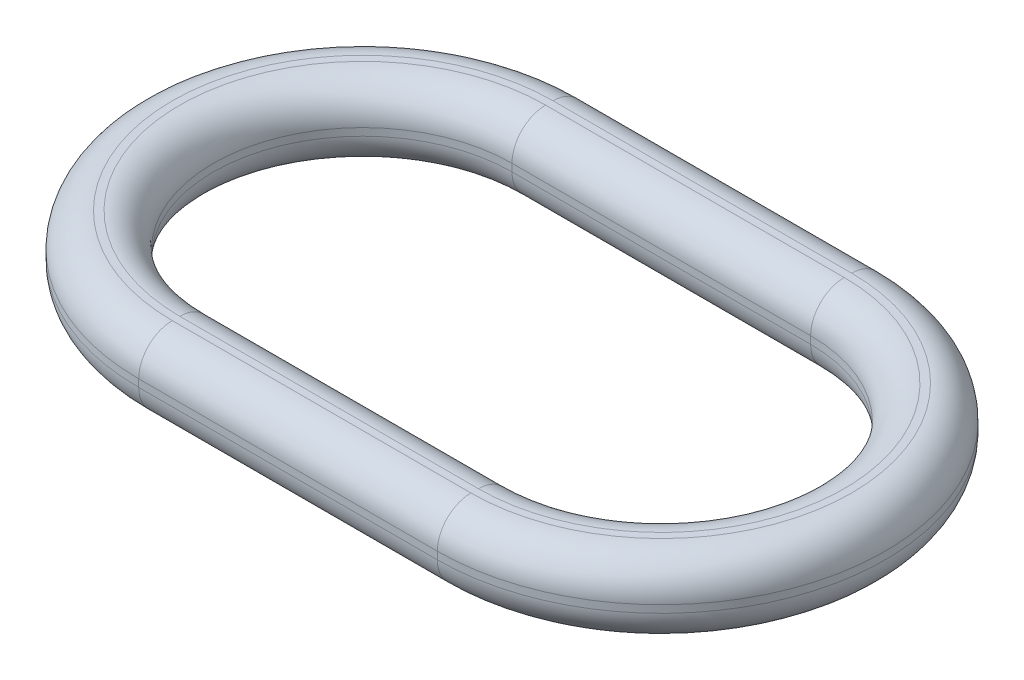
from build123d import *

# Parameters (mm, degrees)
BOSS_EXTRUDE2_DEPTH = 1
FILLET2_R           = 0.45


with BuildPart() as part:
    # Sketch2 → Boss-Extrude2 (new body)
    with BuildSketch(Plane(origin=(0, 0, 0), x_dir=(1, 0, 0), z_dir=(0, 1, 0))):
        with BuildLine():
            Line((0, 3), (4, 3))
            ThreePointArc((4, 3), (7, 0), (4, -3))
            Line((4, -3), (0, -3))
            ThreePointArc((0, -3), (-3, 0), (0, 3))
        make_face()
        with BuildLine():
            Line((0, 2), (4, 2))
            ThreePointArc((4, 2), (6, 0), (4, -2))
            Line((4, -2), (0, -2))
            ThreePointArc((0, -2), (-2, 0), (0, 2))
        make_face(mode=Mode.SUBTRACT)
    extrude(amount=BOSS_EXTRUDE2_DEPTH)

    # Fillet2
    fillet2_edges = [part.edges().sort_by_distance(p)[0] for p in [
        (7, 1, 0),
        (2, 1, -3),
        (-2, 0, 0),
        (2, 0, 2),
        (6, 0, 0),
        (2, 0, -2),
        (-2, 1, 0),
        (2, 1, 2),
        (6, 1, 0),
        (2, 1, -2),
        (-3, 1, 0),
        (2, 0, -3),
        (7, 0, 0),
        (2, 0, 3),
        (-3, 0, 0),
        (2, 1, 3),
    ]]
    fillet(fillet2_edges, radius=FILLET2_R)


solid = part.part
